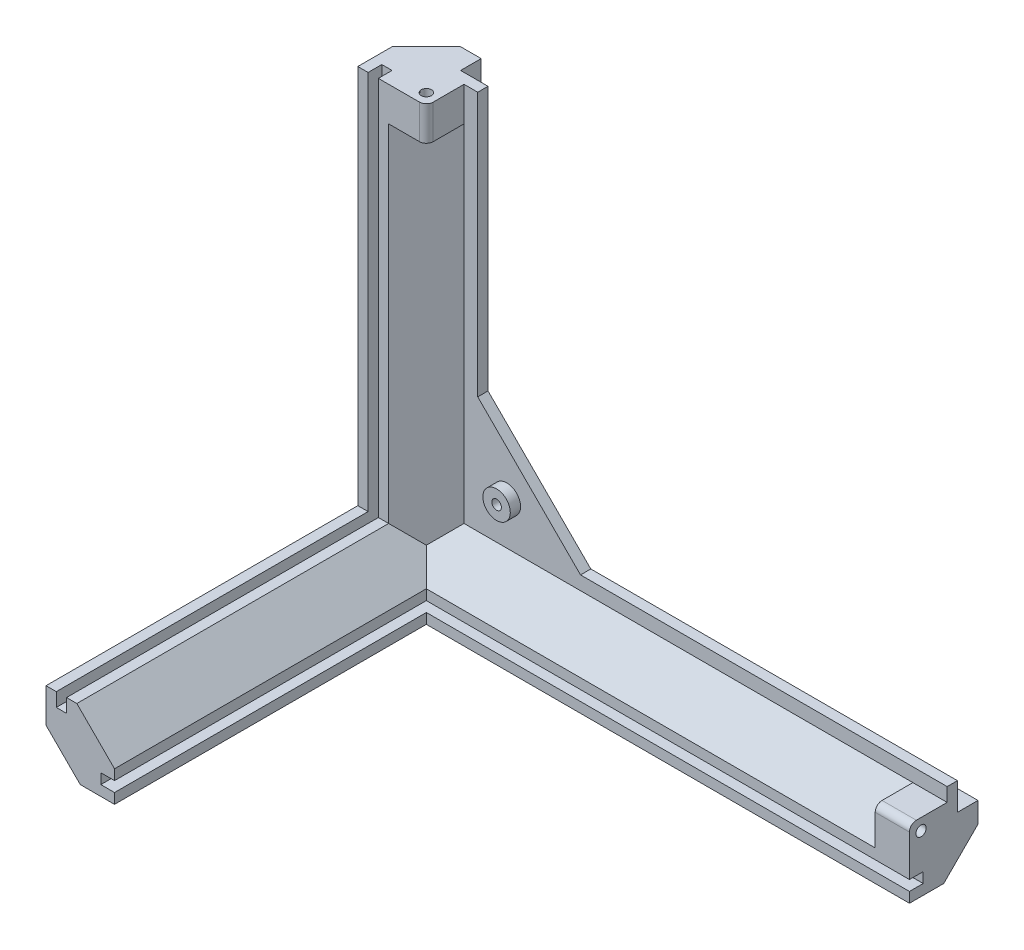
from build123d import *

# Parameters (mm, degrees)
BOSS_EXTRUDE1_DEPTH  = 111
BOSS_EXTRUDE2_DEPTH  = 91
BOSS_EXTRUDE3_DEPTH  = 141
SKETCH4_W            = 20
SKETCH4_H            = 20
BOSS_EXTRUDE4_DEPTH  = 20
CUT_EXTRUDE1_DEPTH   = 20
CUT_EXTRUDE2_DEPTH   = 20
CUT_EXTRUDE3_DEPTH   = 20
SKETCH8_W            = 4
SKETCH8_H            = 3
CUT_EXTRUDE4_DEPTH   = 4
SKETCH9_W            = 3
SKETCH9_H            = 4
CUT_EXTRUDE5_DEPTH   = 4
SKETCH10_W           = 3
SKETCH10_H           = 4
CUT_EXTRUDE6_DEPTH   = 4
CUT_EXTRUDE7_DEPTH   = 11
BOSS_EXTRUDE5_DEPTH  = 10
BOSS_EXTRUDE6_DEPTH  = 10
CUT_EXTRUDE8_DEPTH   = 10
SKETCH15_W           = 141
SKETCH15_H           = 3
BOSS_EXTRUDE7_DEPTH  = 4
SKETCH16_W           = 3
SKETCH16_H           = 107
BOSS_EXTRUDE8_DEPTH  = 4
CHAMFER1_SIZE        = 30
CHAMFER2_SIZE        = 20
SKETCH17_R           = 1.4
CUT_EXTRUDE9_DEPTH   = 184.126496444
SKETCH20_R           = 1.5
BOSS_EXTRUDE10_DEPTH = 10
SKETCH21_R           = 1.5
BOSS_EXTRUDE11_DEPTH = 10
FILLET1_R            = 2
ESQUISSE1_R          = 4
ESQUISSE1_R_2        = 1.4
BOSS_EXTRU_1_DEPTH   = 3


with BuildPart() as part:
    # Sketch1 → Boss-Extrude1 (new body)
    with BuildSketch(Plane(origin=(0, 0, 0), x_dir=(1, 0, 0), z_dir=(0, 1, 0))):
        Polygon((-60.05786955, 3.452266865), (-50.05786955, 13.452266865), (-40.05786955, 13.452266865), (-40.05786955, 10.452266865), (-44.05786955, 10.452266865), (-44.05786955, 7.452266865), (-40.05786955, 7.452266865), (-40.05786955, 4.452266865), (-51.05786955, -6.547733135), (-54.05786955, -6.547733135), (-54.05786955, -2.547733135), (-57.05786955, -2.547733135), (-57.05786955, -6.547733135), (-60.05786955, -6.547733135), align=None)
    extrude(amount=BOSS_EXTRUDE1_DEPTH)



with BuildPart() as body_2:
    # Sketch2 → Boss-Extrude2 (new body)
    with BuildSketch(Plane.XY.offset(6.547733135)):
        Polygon((-57.05786955, 0), (-57.05786955, -4), (-54.05786955, -4), (-54.05786955, 0), (-51.05786955, 0), (-40.05786955, -11), (-40.05786955, -14), (-44.05786955, -14), (-44.05786955, -17), (-40.05786955, -17), (-40.05786955, -20), (-50.05786955, -20), (-60.05786955, -10), (-60.05786955, 0), align=None)
    extrude(amount=BOSS_EXTRUDE2_DEPTH)


with BuildPart() as body_3:
    # Sketch3 → Boss-Extrude3 (new body)
    with BuildSketch(Plane(origin=(-40.05786955, 0, 0), x_dir=(0, 0, -1), z_dir=(1, 0, 0))):
        Polygon((-6.547733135, -11), (-6.547733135, -14), (-2.547733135, -14), (-2.547733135, -17), (-6.547733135, -17), (-6.547733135, -20), (3.452266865, -20), (13.452266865, -10), (13.452266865, 0), (10.452266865, 0), (10.452266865, -4), (7.452266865, -4), (7.452266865, 0), (4.452266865, 0), align=None)
    extrude(amount=BOSS_EXTRUDE3_DEPTH)


with BuildPart() as part_1:
    add(part.part)

    add(body_2.part)  # Boss-Extrude4 merges body 2

    add(body_3.part)  # Boss-Extrude4 merges body 3
    # Sketch4 → Boss-Extrude4 (add)
    with BuildSketch(Plane(origin=(0, 0, -13.452266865), x_dir=(-1, 0, 0), z_dir=(0, 0, -1))):
        with Locations((50.05786955, -10)):
            Rectangle(SKETCH4_W, SKETCH4_H)
    extrude(amount=-BOSS_EXTRUDE4_DEPTH)

    # Sketch5 → Cut-Extrude1 (cut)
    with BuildSketch(Plane.XY.offset(6.547733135)):
        Polygon((-50.05786955, -20), (-60.05786955, -10), (-60.05786955, -20), align=None)
    extrude(amount=-CUT_EXTRUDE1_DEPTH, mode=Mode.SUBTRACT)

    # Sketch6 → Cut-Extrude2 (cut)
    with BuildSketch(Plane(origin=(0, 0, 0), x_dir=(1, 0, 0), z_dir=(0, 1, 0))):
        Polygon((-60.05786955, 3.452266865), (-50.05786955, 13.452266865), (-60.05786955, 13.452266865), align=None)
    extrude(amount=-CUT_EXTRUDE2_DEPTH, mode=Mode.SUBTRACT)

    # Sketch7 → Cut-Extrude3 (cut)
    with BuildSketch(Plane(origin=(-40.05786955, 0, 0), x_dir=(0, 0, -1), z_dir=(1, 0, 0))):
        Polygon((13.452266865, -10), (3.452266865, -20), (13.452266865, -20), align=None)
    extrude(amount=-CUT_EXTRUDE3_DEPTH, mode=Mode.SUBTRACT)

    # Sketch8 → Cut-Extrude4 (cut)
    with BuildSketch(Plane(origin=(-40.05786955, 0, 0), x_dir=(0, 0, -1), z_dir=(1, 0, 0))):
        with Locations((-4.547733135, -15.5)):
            Rectangle(SKETCH8_W, SKETCH8_H)
    extrude(amount=-CUT_EXTRUDE4_DEPTH, mode=Mode.SUBTRACT)

    # Sketch9 → Cut-Extrude5 (cut)
    with BuildSketch(Plane(origin=(-40.05786955, 0, 0), x_dir=(0, 0, -1), z_dir=(1, 0, 0))):
        with Locations((8.952266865, -2)):
            Rectangle(SKETCH9_W, SKETCH9_H)
    extrude(amount=-CUT_EXTRUDE5_DEPTH, mode=Mode.SUBTRACT)

    # Sketch10 → Cut-Extrude6 (cut)
    with BuildSketch(Plane(origin=(0, 0, 0), x_dir=(1, 0, 0), z_dir=(0, 1, 0))):
        with Locations((-55.55786955, -4.547733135)):
            Rectangle(SKETCH10_W, SKETCH10_H)
    extrude(amount=-CUT_EXTRUDE6_DEPTH, mode=Mode.SUBTRACT)

    # Sketch11 → Cut-Extrude7 (cut)
    with BuildSketch(Plane(origin=(0, 0, 0), x_dir=(1, 0, 0), z_dir=(0, 1, 0))):
        Polygon((-51.05786955, -6.547733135), (-40.05786955, 4.452266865), (-40.05786955, -6.547733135), align=None)
    extrude(amount=-CUT_EXTRUDE7_DEPTH, mode=Mode.SUBTRACT)

    # Sketch12 → Boss-Extrude5 (add)
    with BuildSketch(Plane.ZY.offset(40.05786955)):
        Polygon((6.547733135, -11), (-4.452266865, -11), (-4.452266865, 0), align=None)
    extrude(amount=BOSS_EXTRUDE5_DEPTH)

    # Sketch13 → Boss-Extrude6 (add)
    with BuildSketch(Plane(origin=(0, 0, 6.547733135), x_dir=(-1, 0, 0), z_dir=(0, 0, -1))):
        Polygon((40.05786955, -11), (51.05786955, -11), (51.05786955, 0), align=None)
    extrude(amount=BOSS_EXTRUDE6_DEPTH)

    # Sketch14 → Cut-Extrude8 (cut)
    with BuildSketch(Plane.XY.offset(-10.452266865)):
        Polygon((-44.05786955, -4), (-44.05786955, 111), (-40.05786955, 111), (-40.05786955, 0), (100.94213045, 0), (100.94213045, -4), align=None)
    extrude(amount=-CUT_EXTRUDE8_DEPTH, mode=Mode.SUBTRACT)

    # Sketch15 → Boss-Extrude7 (add)
    with BuildSketch(Plane(origin=(0, 0, 0), x_dir=(1, 0, 0), z_dir=(0, 1, 0))):
        with Locations((30.44213045, 5.952266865)):
            Rectangle(SKETCH15_W, SKETCH15_H)
    extrude(amount=BOSS_EXTRUDE7_DEPTH)

    # Sketch16 → Boss-Extrude8 (add)
    with BuildSketch(Plane(origin=(-40.05786955, 0, 0), x_dir=(0, 0, -1), z_dir=(1, 0, 0))):
        with Locations((5.952266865, 57.5)):
            Rectangle(SKETCH16_W, SKETCH16_H)
    extrude(amount=BOSS_EXTRUDE8_DEPTH)

    # Chamfer1
    chamfer1_edges = [part_1.edges().sort_by_distance(p)[0] for p in [
        (-36.05786955, 4, -5.952266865),
    ]]
    chamfer(chamfer1_edges, length=CHAMFER1_SIZE)

    # Chamfer2
    chamfer2_edges = [part_1.edges().sort_by_distance(p)[0] for p in [
        (-44.05786955, -4, -10.452266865),
    ]]
    chamfer(chamfer2_edges, length=CHAMFER2_SIZE)

    # Sketch17 → Cut-Extrude9 (cut, through all)
    with BuildSketch(Plane(origin=(0, 0, -7.452266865), x_dir=(-1, 0, 0), z_dir=(0, 0, -1))):
        with Locations((27.55786955, 12.5)):
            Circle(SKETCH17_R)
    extrude(amount=-CUT_EXTRUDE9_DEPTH, mode=Mode.SUBTRACT)

    # Sketch20 → Boss-Extrude10 (add)
    with BuildSketch(Plane(origin=(0, 111, 0), x_dir=(1, 0, 0), z_dir=(0, 1, 0))):
        Polygon((-40.05786955, 4.452266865), (-40.05786955, -6.547733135), (-51.05786955, -6.547733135), align=None)
        with Locations(Location((-43.436549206, -3.169053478, 0), (0, 0, 270))):
            Circle(SKETCH20_R, mode=Mode.SUBTRACT)
    extrude(amount=-BOSS_EXTRUDE10_DEPTH)

    # Sketch21 → Boss-Extrude11 (add)
    with BuildSketch(Plane(origin=(100.94213045, 0, 0), x_dir=(0, 0, -1), z_dir=(1, 0, 0))):
        Polygon((4.452266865, 0), (-6.547733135, 0), (-6.547733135, -11), align=None)
        with Locations((-3.169053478, -3.378679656)):
            Circle(SKETCH21_R, mode=Mode.SUBTRACT)
    extrude(amount=-BOSS_EXTRUDE11_DEPTH)

    # Fillet1
    fillet1_edges = [part_1.edges().sort_by_distance(p)[0] for p in [
        (-40.05786955, 106, 6.547733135),
        (95.94213045, 0, 6.547733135),
    ]]
    fillet(fillet1_edges, radius=FILLET1_R)

    # Esquisse1 → Boss.-Extru.1 (add)
    with BuildSketch(Plane.XY.offset(-4.452266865)):
        with Locations(Location((-27.55786955, 12.5, 0), (0, 0, 180))):
            Circle(ESQUISSE1_R)
        with Locations(Location((-27.55786955, 12.5, 0), (0, 0, 180))):
            Circle(ESQUISSE1_R_2, mode=Mode.SUBTRACT)
    extrude(amount=BOSS_EXTRU_1_DEPTH)


solid = part_1.part
